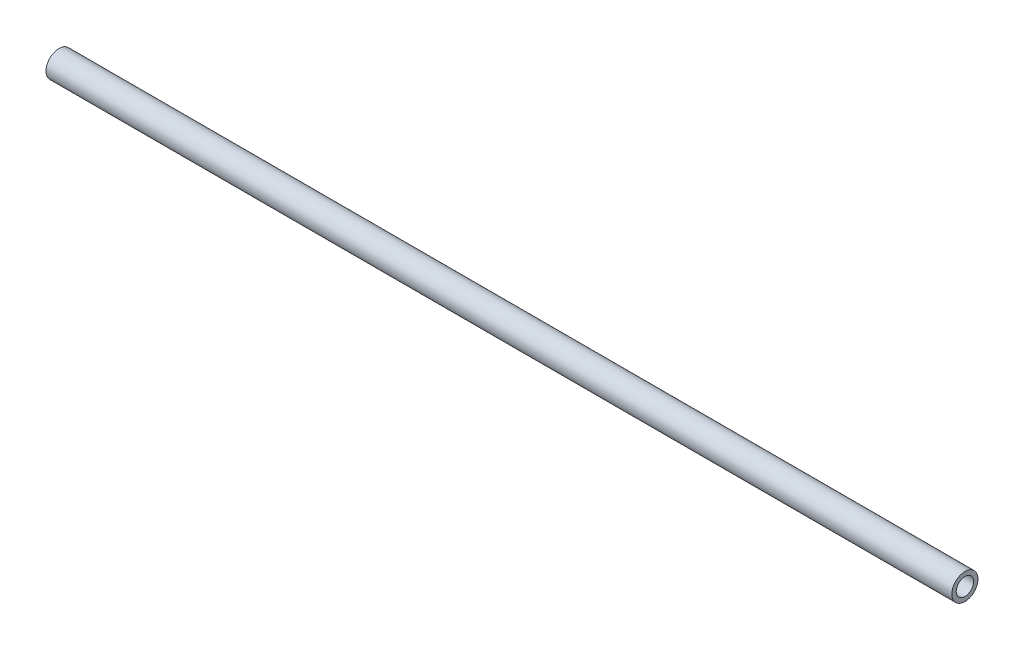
ISO-10303-21;
HEADER;
FILE_DESCRIPTION(('STEP AP214'),'2;1');
FILE_NAME('part.step','',(''),(''),'','','');
FILE_SCHEMA(('AUTOMOTIVE_DESIGN { 1 0 10303 214 1 1 1 1 }'));
ENDSEC;
DATA;
#1=APPLICATION_CONTEXT('core data for automotive mechanical design processes');
#2=APPLICATION_PROTOCOL_DEFINITION('international standard','automotive_design',2000,#1);
#3=PRODUCT_CONTEXT('',#1,'mechanical');
#4=PRODUCT('Part','Part','',(#3));
#5=PRODUCT_RELATED_PRODUCT_CATEGORY('part','',(#4));
#6=PRODUCT_DEFINITION_FORMATION('','',#4);
#7=PRODUCT_DEFINITION_CONTEXT('part definition',#1,'design');
#8=PRODUCT_DEFINITION('design','',#6,#7);
#9=PRODUCT_DEFINITION_SHAPE('','',#8);
#10=(LENGTH_UNIT() NAMED_UNIT(*) SI_UNIT(.MILLI.,.METRE.));
#11=(NAMED_UNIT(*) PLANE_ANGLE_UNIT() SI_UNIT($,.RADIAN.));
#12=(NAMED_UNIT(*) SI_UNIT($,.STERADIAN.) SOLID_ANGLE_UNIT());
#13=UNCERTAINTY_MEASURE_WITH_UNIT(LENGTH_MEASURE(1.E-05),#10,'distance_accuracy_value','');
#14=(GEOMETRIC_REPRESENTATION_CONTEXT(3) GLOBAL_UNCERTAINTY_ASSIGNED_CONTEXT((#13)) GLOBAL_UNIT_ASSIGNED_CONTEXT((#10,
#11,#12)) REPRESENTATION_CONTEXT('',''));
#15=CARTESIAN_POINT('',(0.,0.,0.));
#16=DIRECTION('',(0.,0.,1.));
#17=DIRECTION('',(1.,0.,0.));
#18=AXIS2_PLACEMENT_3D('',#15,#16,#17);
#19=CARTESIAN_POINT('',(330.2,0.,0.));
#20=DIRECTION('',(1.,0.,0.));
#21=DIRECTION('',(0.,0.,-1.));
#22=AXIS2_PLACEMENT_3D('',#19,#20,#21);
#23=PLANE('',#22);
#24=CARTESIAN_POINT('',(330.2,0.,0.));
#25=DIRECTION('',(1.,0.,0.));
#26=DIRECTION('',(0.,0.,-1.));
#27=AXIS2_PLACEMENT_3D('',#24,#25,#26);
#28=CIRCLE('',#27,4.7625);
#29=CARTESIAN_POINT('',(330.2,0.,-4.7625));
#30=VERTEX_POINT('',#29);
#31=EDGE_CURVE('E10',#30,#30,#28,.T.);
#32=ORIENTED_EDGE('',*,*,#31,.T.);
#33=EDGE_LOOP('',(#32));
#34=FACE_BOUND('',#33,.T.);
#35=CARTESIAN_POINT('',(330.2,0.,0.));
#36=DIRECTION('',(1.,0.,0.));
#37=DIRECTION('',(0.,0.,-1.));
#38=AXIS2_PLACEMENT_3D('',#35,#36,#37);
#39=CIRCLE('',#38,3.175);
#40=CARTESIAN_POINT('',(330.2,0.,-3.175));
#41=VERTEX_POINT('',#40);
#42=EDGE_CURVE('E54',#41,#41,#39,.T.);
#43=ORIENTED_EDGE('',*,*,#42,.F.);
#44=EDGE_LOOP('',(#43));
#45=FACE_BOUND('',#44,.T.);
#46=ADVANCED_FACE('F41',(#34,#45),#23,.T.);
#47=CARTESIAN_POINT('',(0.,0.,0.));
#48=DIRECTION('',(1.,0.,0.));
#49=DIRECTION('',(0.,0.,-1.));
#50=AXIS2_PLACEMENT_3D('',#47,#48,#49);
#51=PLANE('',#50);
#52=CARTESIAN_POINT('',(0.,0.,0.));
#53=DIRECTION('',(1.,0.,0.));
#54=DIRECTION('',(0.,0.,-1.));
#55=AXIS2_PLACEMENT_3D('',#52,#53,#54);
#56=CIRCLE('',#55,4.7625);
#57=CARTESIAN_POINT('',(0.,0.,-4.7625));
#58=VERTEX_POINT('',#57);
#59=EDGE_CURVE('E45',#58,#58,#56,.T.);
#60=ORIENTED_EDGE('',*,*,#59,.F.);
#61=EDGE_LOOP('',(#60));
#62=FACE_BOUND('',#61,.T.);
#63=CARTESIAN_POINT('',(0.,0.,0.));
#64=DIRECTION('',(1.,0.,0.));
#65=DIRECTION('',(0.,0.,-1.));
#66=AXIS2_PLACEMENT_3D('',#63,#64,#65);
#67=CIRCLE('',#66,3.175);
#68=CARTESIAN_POINT('',(0.,0.,-3.175));
#69=VERTEX_POINT('',#68);
#70=EDGE_CURVE('E56',#69,#69,#67,.T.);
#71=ORIENTED_EDGE('',*,*,#70,.T.);
#72=EDGE_LOOP('',(#71));
#73=FACE_BOUND('',#72,.T.);
#74=ADVANCED_FACE('F68',(#62,#73),#51,.F.);
#75=CARTESIAN_POINT('',(330.2,0.,0.));
#76=DIRECTION('',(-1.,0.,0.));
#77=DIRECTION('',(0.,0.,1.));
#78=AXIS2_PLACEMENT_3D('',#75,#76,#77);
#79=CYLINDRICAL_SURFACE('',#78,4.7625);
#80=ORIENTED_EDGE('',*,*,#31,.F.);
#81=EDGE_LOOP('',(#80));
#82=FACE_BOUND('',#81,.T.);
#83=ORIENTED_EDGE('',*,*,#59,.T.);
#84=EDGE_LOOP('',(#83));
#85=FACE_BOUND('',#84,.T.);
#86=ADVANCED_FACE('F43',(#82,#85),#79,.T.);
#87=CARTESIAN_POINT('',(330.2,0.,0.));
#88=DIRECTION('',(-1.,0.,0.));
#89=DIRECTION('',(0.,0.,1.));
#90=AXIS2_PLACEMENT_3D('',#87,#88,#89);
#91=CYLINDRICAL_SURFACE('',#90,3.175);
#92=ORIENTED_EDGE('',*,*,#42,.T.);
#93=EDGE_LOOP('',(#92));
#94=FACE_BOUND('',#93,.T.);
#95=ORIENTED_EDGE('',*,*,#70,.F.);
#96=EDGE_LOOP('',(#95));
#97=FACE_BOUND('',#96,.T.);
#98=ADVANCED_FACE('F64',(#94,#97),#91,.F.);
#99=CLOSED_SHELL('',(#46,#74,#86,#98));
#100=MANIFOLD_SOLID_BREP('B2',#99);
#101=ADVANCED_BREP_SHAPE_REPRESENTATION('',(#18,#100),#14);
#102=SHAPE_DEFINITION_REPRESENTATION(#9,#101);
ENDSEC;
END-ISO-10303-21;
